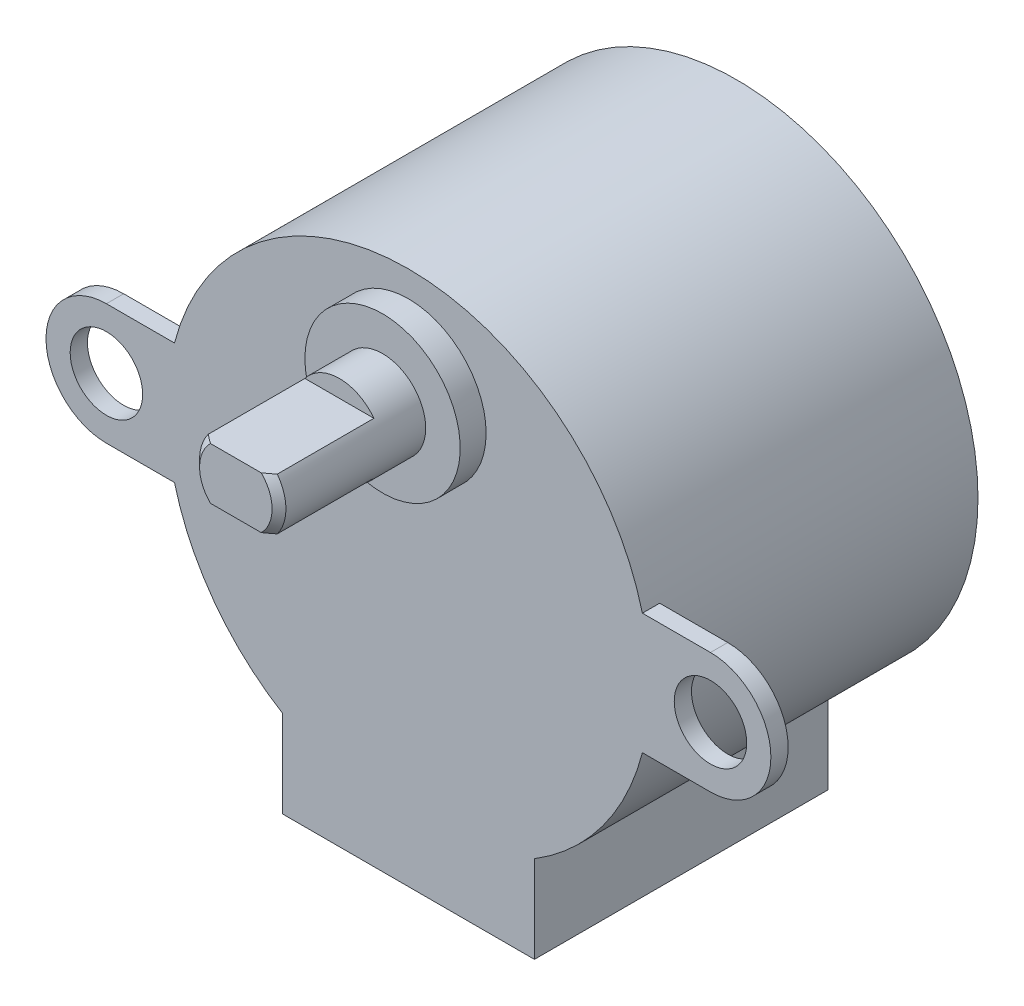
from build123d import *

# Parameters (mm, degrees)
SCHIZZO1_R                   = 14
ESTRUSIONE_ESTRUSIONE1_DEPTH = 19
ESTRUSIONE_ESTRUSIONE2_DEPTH = 1
SCHIZZO3_R                   = 2.1
TAGLIO_ESTRUSIONE1_DEPTH     = 1
ESTRUSIONE_ESTRUSIONE3_START = -1
SCHIZZO4_W                   = 14.6
SCHIZZO4_H                   = 6
ESTRUSIONE_ESTRUSIONE3_DEPTH = 17
ESTRUSIONE_ESTRUSIONE4_START = -1
SCHIZZO5_R                   = 4.5
ESTRUSIONE_ESTRUSIONE4_DEPTH = 1.5
SCHIZZO6_R                   = 2.5
ESTRUSIONE_ESTRUSIONE5_DEPTH = 8.5
SCHIZZO7_W                   = 5
SCHIZZO7_H                   = 2
TAGLIO_ESTRUSIONE2_DEPTH     = 6
SMUSSO1_SIZE                 = 0.4


with BuildPart() as part:
    # Schizzo1 → Estrusione-Estrusione1 (new body)
    with BuildSketch(Plane.XY):
        Circle(SCHIZZO1_R)
    extrude(amount=ESTRUSIONE_ESTRUSIONE1_DEPTH)

    # Schizzo2 → Estrusione-Estrusione2 (add)
    with BuildSketch(Plane.XY.offset(19)):
        with BuildLine():
            Line((13.03840481, -3.5), (17.5, -3.5))
            ThreePointArc((17.5, -3.5), (21, 0), (17.5, 3.5))
            Line((17.5, 3.5), (13.03840481, 3.5))
            ThreePointArc((13.03840481, 3.5), (0, 13.5), (-13.03840481, 3.5))
            Line((-13.03840481, 3.5), (-17.5, 3.5))
            ThreePointArc((-17.5, 3.5), (-21, 0), (-17.5, -3.5))
            Line((-17.5, -3.5), (-13.03840481, -3.5))
            ThreePointArc((-13.03840481, -3.5), (0, -13.5), (13.03840481, -3.5))
        make_face()
    extrude(amount=-ESTRUSIONE_ESTRUSIONE2_DEPTH)

    # Schizzo3 → Taglio-Estrusione1 (cut)
    with BuildSketch(Plane(origin=(0, 0, 18), x_dir=(-1, 0, 0), z_dir=(0, 0, -1))):
        with Locations((-17.5, 0)):
            Circle(SCHIZZO3_R)
        with Locations((17.5, 0)):
            Circle(SCHIZZO3_R)
    extrude(amount=-TAGLIO_ESTRUSIONE1_DEPTH, mode=Mode.SUBTRACT)

    # Schizzo4 → Estrusione-Estrusione3 (add)
    with BuildSketch(Plane(origin=(0, 0, 18), x_dir=(-1, 0, 0), z_dir=(0, 0, -1)).offset(ESTRUSIONE_ESTRUSIONE3_START)):
        with Locations((0, -14)):
            Rectangle(SCHIZZO4_W, SCHIZZO4_H)
    extrude(amount=ESTRUSIONE_ESTRUSIONE3_DEPTH)

    # Schizzo5 → Estrusione-Estrusione4 (add)
    with BuildSketch(Plane(origin=(0, 0, 18), x_dir=(-1, 0, 0), z_dir=(0, 0, -1)).offset(ESTRUSIONE_ESTRUSIONE4_START)):
        with Locations((0, 8)):
            Circle(SCHIZZO5_R)
    extrude(amount=-ESTRUSIONE_ESTRUSIONE4_DEPTH)

    # Schizzo6 → Estrusione-Estrusione5 (add)
    with BuildSketch(Plane.XY.offset(20.5)):
        with Locations((0, 8)):
            Circle(SCHIZZO6_R)
    extrude(amount=ESTRUSIONE_ESTRUSIONE5_DEPTH)

    # Schizzo7 → Taglio-Estrusione2 (cut)
    with BuildSketch(Plane.XY.offset(29)):
        with Locations((0, 10.5)):
            Rectangle(SCHIZZO7_W, SCHIZZO7_H)
        with Locations((0, 5.5)):
            Rectangle(SCHIZZO7_W, SCHIZZO7_H)
    extrude(amount=-TAGLIO_ESTRUSIONE2_DEPTH, mode=Mode.SUBTRACT)

    # Smusso1
    smusso1_edges = [part.edges().sort_by_distance(p)[0] for p in [
        (-2.5, 8, 29),
        (2.371708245, 8.790569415, 29),
    ]]
    chamfer(smusso1_edges, length=SMUSSO1_SIZE)


solid = part.part
